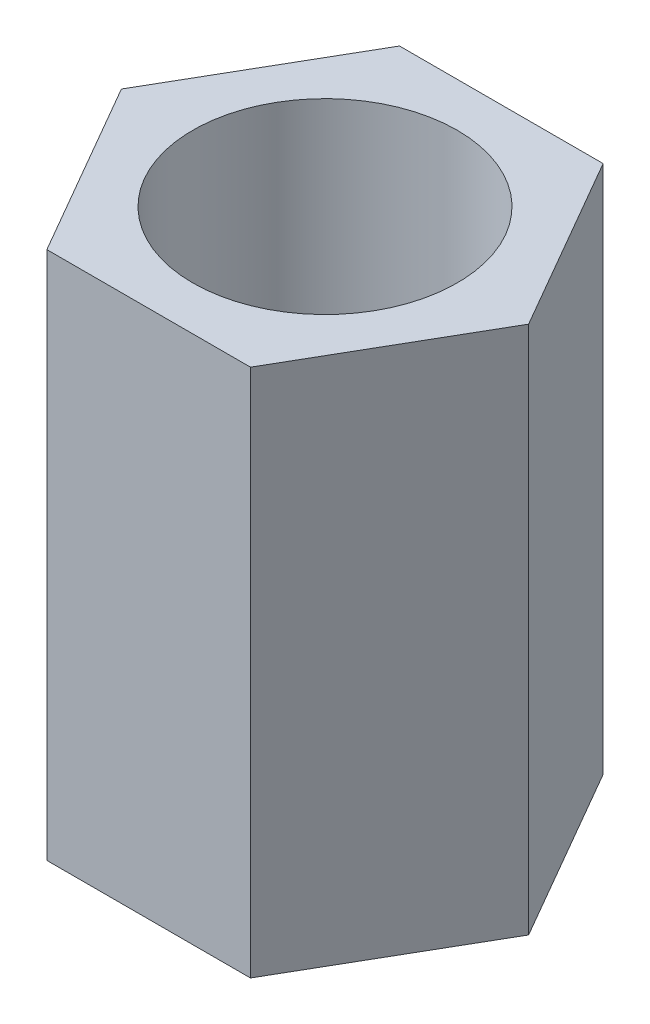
from build123d import *

# Parameters (mm, degrees)
CROQUIS1_R              = 1.5
SALIENTE_EXTRUIR1_DEPTH = 3


with BuildPart() as part:
    # Croquis1 → Saliente-Extruir1 (new, symmetric)
    with BuildSketch(Plane(origin=(0, 0, 0), x_dir=(1, 0, 0), z_dir=(0, 1, 0))):
        Polygon((1.154700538, 2), (-1.154700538, 2), (-2.309401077, 0), (-1.154700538, -2), (1.154700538, -2), (2.309401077, 0), align=None)
        with Locations(Location((0, 0, 0), (0, 0, 270))):
            Circle(CROQUIS1_R, mode=Mode.SUBTRACT)
    extrude(amount=SALIENTE_EXTRUIR1_DEPTH, both=True)


solid = part.part
